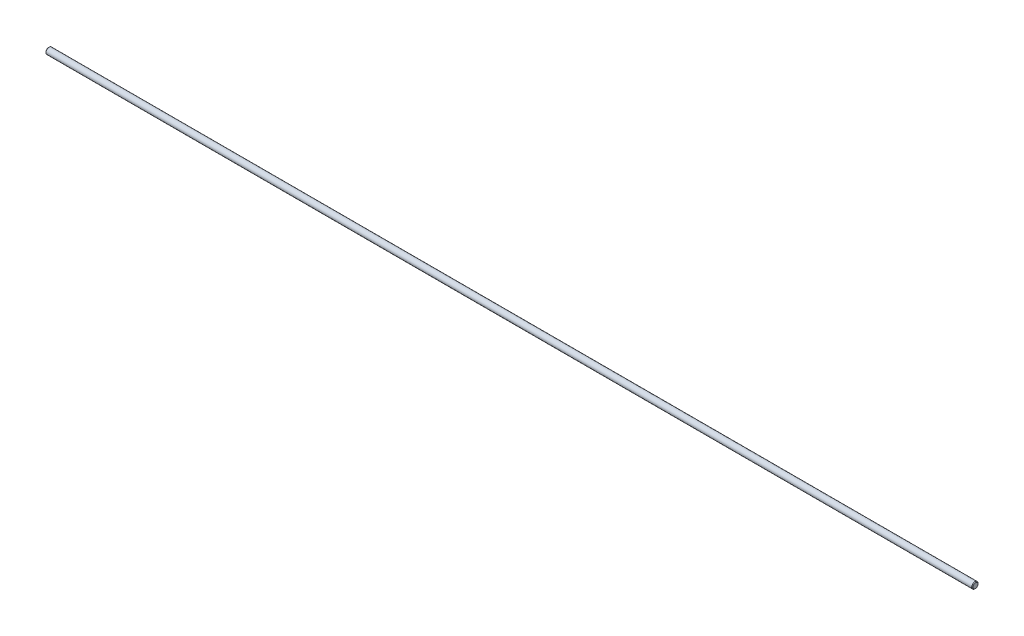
ISO-10303-21;
HEADER;
FILE_DESCRIPTION(('STEP AP214'),'2;1');
FILE_NAME('part.step','',(''),(''),'','','');
FILE_SCHEMA(('AUTOMOTIVE_DESIGN { 1 0 10303 214 1 1 1 1 }'));
ENDSEC;
DATA;
#1=APPLICATION_CONTEXT('core data for automotive mechanical design processes');
#2=APPLICATION_PROTOCOL_DEFINITION('international standard','automotive_design',2000,#1);
#3=PRODUCT_CONTEXT('',#1,'mechanical');
#4=PRODUCT('Part','Part','',(#3));
#5=PRODUCT_RELATED_PRODUCT_CATEGORY('part','',(#4));
#6=PRODUCT_DEFINITION_FORMATION('','',#4);
#7=PRODUCT_DEFINITION_CONTEXT('part definition',#1,'design');
#8=PRODUCT_DEFINITION('design','',#6,#7);
#9=PRODUCT_DEFINITION_SHAPE('','',#8);
#10=(LENGTH_UNIT() NAMED_UNIT(*) SI_UNIT(.MILLI.,.METRE.));
#11=(NAMED_UNIT(*) PLANE_ANGLE_UNIT() SI_UNIT($,.RADIAN.));
#12=(NAMED_UNIT(*) SI_UNIT($,.STERADIAN.) SOLID_ANGLE_UNIT());
#13=UNCERTAINTY_MEASURE_WITH_UNIT(LENGTH_MEASURE(1.E-05),#10,'distance_accuracy_value','');
#14=(GEOMETRIC_REPRESENTATION_CONTEXT(3) GLOBAL_UNCERTAINTY_ASSIGNED_CONTEXT((#13)) GLOBAL_UNIT_ASSIGNED_CONTEXT((#10,
#11,#12)) REPRESENTATION_CONTEXT('',''));
#15=CARTESIAN_POINT('',(0.,0.,0.));
#16=DIRECTION('',(0.,0.,1.));
#17=DIRECTION('',(1.,0.,0.));
#18=AXIS2_PLACEMENT_3D('',#15,#16,#17);
#19=CARTESIAN_POINT('',(739.,0.,0.));
#20=DIRECTION('',(-1.,0.,0.));
#21=DIRECTION('',(0.,0.,1.));
#22=AXIS2_PLACEMENT_3D('',#19,#20,#21);
#23=CYLINDRICAL_SURFACE('',#22,5.);
#24=CARTESIAN_POINT('',(-737.999999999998,0.,0.));
#25=DIRECTION('',(1.,0.,0.));
#26=DIRECTION('',(0.,0.,-1.));
#27=AXIS2_PLACEMENT_3D('',#24,#25,#26);
#28=CIRCLE('',#27,5.);
#29=CARTESIAN_POINT('',(-737.999999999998,0.,5.));
#30=VERTEX_POINT('',#29);
#31=EDGE_CURVE('E44',#30,#30,#28,.T.);
#32=CARTESIAN_POINT('',(738.,0.,0.));
#33=DIRECTION('',(1.,0.,0.));
#34=DIRECTION('',(0.,0.,-1.));
#35=AXIS2_PLACEMENT_3D('',#32,#33,#34);
#36=CIRCLE('',#35,5.);
#37=CARTESIAN_POINT('',(738.,0.,5.));
#38=VERTEX_POINT('',#37);
#39=EDGE_CURVE('E48',#38,#38,#36,.F.);
#40=CARTESIAN_POINT('',(-737.999999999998,0.,5.));
#41=CARTESIAN_POINT('',(-722.624999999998,0.,5.));
#42=CARTESIAN_POINT('',(-707.249999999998,0.,5.));
#43=CARTESIAN_POINT('',(-676.499999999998,0.,5.));
#44=CARTESIAN_POINT('',(-661.124999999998,0.,5.));
#45=CARTESIAN_POINT('',(-630.374999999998,0.,5.));
#46=CARTESIAN_POINT('',(-614.999999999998,0.,5.));
#47=CARTESIAN_POINT('',(-584.249999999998,0.,5.));
#48=CARTESIAN_POINT('',(-568.874999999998,0.,5.));
#49=CARTESIAN_POINT('',(-538.124999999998,0.,5.));
#50=CARTESIAN_POINT('',(-522.749999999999,0.,5.));
#51=CARTESIAN_POINT('',(-491.999999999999,0.,5.));
#52=CARTESIAN_POINT('',(-476.624999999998,0.,5.));
#53=CARTESIAN_POINT('',(-445.874999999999,0.,5.));
#54=CARTESIAN_POINT('',(-430.499999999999,0.,5.));
#55=CARTESIAN_POINT('',(-399.749999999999,0.,5.));
#56=CARTESIAN_POINT('',(-384.374999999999,0.,5.));
#57=CARTESIAN_POINT('',(-353.624999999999,0.,5.));
#58=CARTESIAN_POINT('',(-338.249999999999,0.,5.));
#59=CARTESIAN_POINT('',(-307.499999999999,0.,5.));
#60=CARTESIAN_POINT('',(-292.124999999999,0.,5.));
#61=CARTESIAN_POINT('',(-261.374999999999,0.,5.));
#62=CARTESIAN_POINT('',(-245.999999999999,0.,5.));
#63=CARTESIAN_POINT('',(-215.249999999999,0.,5.));
#64=CARTESIAN_POINT('',(-199.874999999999,0.,5.));
#65=CARTESIAN_POINT('',(-169.124999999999,0.,5.));
#66=CARTESIAN_POINT('',(-153.749999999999,0.,5.));
#67=CARTESIAN_POINT('',(-122.999999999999,0.,5.));
#68=CARTESIAN_POINT('',(-107.624999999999,0.,5.));
#69=CARTESIAN_POINT('',(-76.874999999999,0.,5.));
#70=CARTESIAN_POINT('',(-61.499999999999,0.,5.));
#71=CARTESIAN_POINT('',(-30.749999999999,0.,5.));
#72=CARTESIAN_POINT('',(-15.374999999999,0.,5.));
#73=CARTESIAN_POINT('',(15.375000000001,0.,5.));
#74=CARTESIAN_POINT('',(30.750000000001,0.,5.));
#75=CARTESIAN_POINT('',(61.500000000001,0.,5.));
#76=CARTESIAN_POINT('',(76.875000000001,0.,5.));
#77=CARTESIAN_POINT('',(107.625000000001,0.,5.));
#78=CARTESIAN_POINT('',(123.000000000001,0.,5.));
#79=CARTESIAN_POINT('',(153.750000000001,0.,5.));
#80=CARTESIAN_POINT('',(169.125000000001,0.,5.));
#81=CARTESIAN_POINT('',(199.875000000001,0.,5.));
#82=CARTESIAN_POINT('',(215.250000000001,0.,5.));
#83=CARTESIAN_POINT('',(246.000000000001,0.,5.));
#84=CARTESIAN_POINT('',(261.375000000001,0.,5.));
#85=CARTESIAN_POINT('',(292.125000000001,0.,5.));
#86=CARTESIAN_POINT('',(307.500000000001,0.,5.));
#87=CARTESIAN_POINT('',(338.250000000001,0.,5.));
#88=CARTESIAN_POINT('',(353.625000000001,0.,5.));
#89=CARTESIAN_POINT('',(384.375000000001,0.,5.));
#90=CARTESIAN_POINT('',(399.750000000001,0.,5.));
#91=CARTESIAN_POINT('',(430.500000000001,0.,5.));
#92=CARTESIAN_POINT('',(445.875000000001,0.,5.));
#93=CARTESIAN_POINT('',(476.625000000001,0.,5.));
#94=CARTESIAN_POINT('',(492.000000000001,0.,5.));
#95=CARTESIAN_POINT('',(522.75,0.,5.));
#96=CARTESIAN_POINT('',(538.125,0.,5.));
#97=CARTESIAN_POINT('',(568.875,0.,5.));
#98=CARTESIAN_POINT('',(584.25,0.,5.));
#99=CARTESIAN_POINT('',(615.,0.,5.));
#100=CARTESIAN_POINT('',(630.375,0.,5.));
#101=CARTESIAN_POINT('',(661.125,0.,5.));
#102=CARTESIAN_POINT('',(676.5,0.,5.));
#103=CARTESIAN_POINT('',(707.25,0.,5.));
#104=CARTESIAN_POINT('',(722.625,0.,5.));
#105=CARTESIAN_POINT('',(738.,0.,5.));
#106=B_SPLINE_CURVE_WITH_KNOTS('',3,(#40,#41,#42,#43,#44,#45,#46,#47,#48,#49,#50,#51,#52,#53,
#54,#55,#56,#57,#58,#59,#60,#61,#62,#63,#64,#65,#66,#67,#68,#69,#70,#71,#72,#73,#74,#75,#76,#77,
#78,#79,#80,#81,#82,#83,#84,#85,#86,#87,#88,#89,#90,#91,#92,#93,#94,#95,#96,#97,#98,#99,#100,
#101,#102,#103,#104,#105),.UNSPECIFIED.,.F.,.F.,(4,2,2,2,2,2,2,2,2,2,2,2,2,2,2,2,2,2,2,2,2,2,2,
2,2,2,2,2,2,2,2,2,4),(0.,46.125,92.2499999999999,138.375,184.5,230.625,276.75,322.875,369.,
415.125,461.25,507.374999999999,553.499999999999,599.624999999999,645.749999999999,
691.874999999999,737.999999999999,784.124999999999,830.249999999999,876.374999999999,
922.499999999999,968.624999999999,1014.75,1060.875,1107.,1153.125,1199.25,1245.375,1291.5,
1337.625,1383.75,1429.875,1476.),.UNSPECIFIED.);
#107=EDGE_CURVE('BSEAM34',#30,#38,#106,.T.);
#108=ORIENTED_EDGE('',*,*,#31,.T.);
#109=ORIENTED_EDGE('',*,*,#39,.T.);
#110=ORIENTED_EDGE('',*,*,#107,.T.);
#111=ORIENTED_EDGE('',*,*,#107,.F.);
#112=EDGE_LOOP('',(#108,#110,#109,#111));
#113=FACE_BOUND('',#112,.T.);
#114=ADVANCED_FACE('F34',(#113),#23,.T.);
#115=CARTESIAN_POINT('',(739.,0.,0.));
#116=DIRECTION('',(1.,0.,0.));
#117=DIRECTION('',(0.,0.,-1.));
#118=AXIS2_PLACEMENT_3D('',#115,#116,#117);
#119=PLANE('',#118);
#120=CARTESIAN_POINT('',(739.,0.,0.));
#121=DIRECTION('',(1.,0.,0.));
#122=DIRECTION('',(0.,0.,-1.));
#123=AXIS2_PLACEMENT_3D('',#120,#121,#122);
#124=CIRCLE('',#123,4.00000000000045);
#125=CARTESIAN_POINT('',(739.,0.,-4.00000000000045));
#126=VERTEX_POINT('',#125);
#127=EDGE_CURVE('E10',#126,#126,#124,.T.);
#128=ORIENTED_EDGE('',*,*,#127,.T.);
#129=EDGE_LOOP('',(#128));
#130=FACE_BOUND('',#129,.T.);
#131=ADVANCED_FACE('F67',(#130),#119,.T.);
#132=CARTESIAN_POINT('',(-739.,0.,0.));
#133=DIRECTION('',(1.,0.,0.));
#134=DIRECTION('',(0.,0.,-1.));
#135=AXIS2_PLACEMENT_3D('',#132,#133,#134);
#136=PLANE('',#135);
#137=CARTESIAN_POINT('',(-739.,0.,0.));
#138=DIRECTION('',(1.,0.,0.));
#139=DIRECTION('',(0.,0.,-1.));
#140=AXIS2_PLACEMENT_3D('',#137,#138,#139);
#141=CIRCLE('',#140,3.99999999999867);
#142=CARTESIAN_POINT('',(-739.,0.,-3.99999999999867));
#143=VERTEX_POINT('',#142);
#144=EDGE_CURVE('E40',#143,#143,#141,.F.);
#145=ORIENTED_EDGE('',*,*,#144,.T.);
#146=EDGE_LOOP('',(#145));
#147=FACE_BOUND('',#146,.T.);
#148=ADVANCED_FACE('F63',(#147),#136,.F.);
#149=CARTESIAN_POINT('',(-737.999999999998,0.,0.));
#150=DIRECTION('',(1.,0.,0.));
#151=DIRECTION('',(0.,0.,-1.));
#152=AXIS2_PLACEMENT_3D('',#149,#150,#151);
#153=CONICAL_SURFACE('',#152,5.,0.785398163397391);
#154=ORIENTED_EDGE('',*,*,#144,.F.);
#155=EDGE_LOOP('',(#154));
#156=FACE_BOUND('',#155,.T.);
#157=ORIENTED_EDGE('',*,*,#31,.F.);
#158=EDGE_LOOP('',(#157));
#159=FACE_BOUND('',#158,.T.);
#160=ADVANCED_FACE('F58',(#156,#159),#153,.T.);
#161=CARTESIAN_POINT('',(739.,0.,0.));
#162=DIRECTION('',(-1.,0.,0.));
#163=DIRECTION('',(0.,0.,1.));
#164=AXIS2_PLACEMENT_3D('',#161,#162,#163);
#165=CONICAL_SURFACE('',#164,4.00000000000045,0.785398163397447);
#166=ORIENTED_EDGE('',*,*,#39,.F.);
#167=EDGE_LOOP('',(#166));
#168=FACE_BOUND('',#167,.T.);
#169=ORIENTED_EDGE('',*,*,#127,.F.);
#170=EDGE_LOOP('',(#169));
#171=FACE_BOUND('',#170,.T.);
#172=ADVANCED_FACE('F55',(#168,#171),#165,.T.);
#173=CLOSED_SHELL('',(#114,#131,#148,#160,#172));
#174=MANIFOLD_SOLID_BREP('B2',#173);
#175=ADVANCED_BREP_SHAPE_REPRESENTATION('',(#18,#174),#14);
#176=SHAPE_DEFINITION_REPRESENTATION(#9,#175);
ENDSEC;
END-ISO-10303-21;
